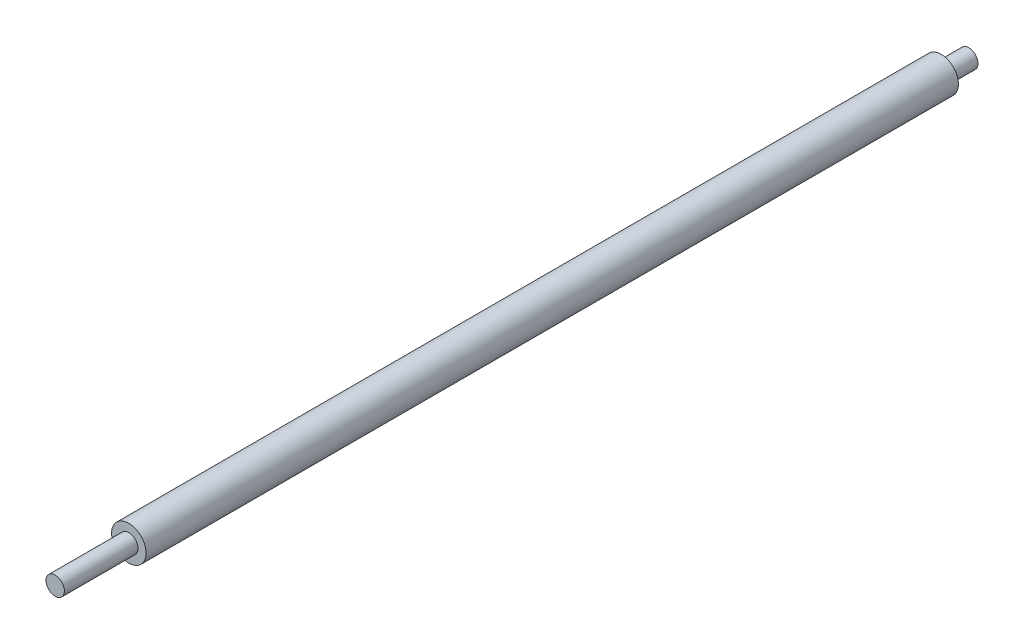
from build123d import *

# Parameters (mm, degrees)
CROQUIS1_R     = 7.5
EXTRUIR2_DEPTH = 353
CROQUIS3_R     = 4
EXTRUIR3_DEPTH = 32
EXTRUIR4_START = 12
CROQUIS4_R     = 4
EXTRUIR4_DEPTH = 12


with BuildPart() as part:
    # Croquis1 → Extruir2 (new body)
    with BuildSketch(Plane.XY):
        Circle(CROQUIS1_R)
    extrude(amount=EXTRUIR2_DEPTH)

    # Croquis3 → Extruir3 (add)
    with BuildSketch(Plane.XY.offset(353)):
        Circle(CROQUIS3_R)
    extrude(amount=EXTRUIR3_DEPTH)

    # Croquis4 → Extruir4 (add)
    with BuildSketch(Plane(origin=(0, 0, 0), x_dir=(-1, 0, 0), z_dir=(0, 0, -1)).offset(EXTRUIR4_START)):
        with Locations(Location((0, 0, 0), (0, 0, 180))):
            Circle(CROQUIS4_R)
    extrude(amount=-EXTRUIR4_DEPTH)


solid = part.part
